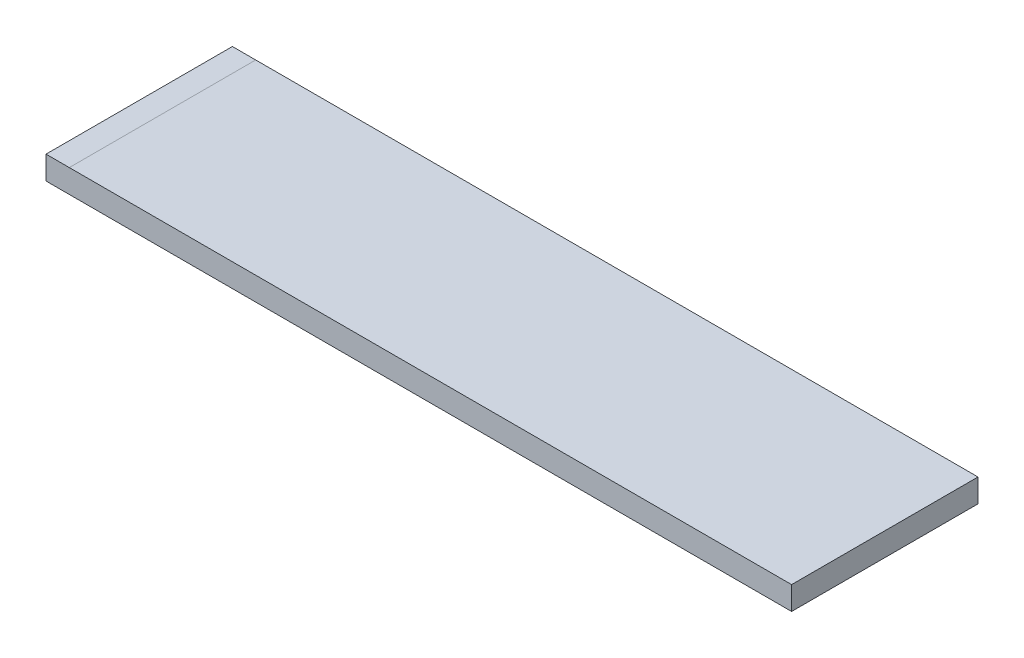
from build123d import *

# Parameters (mm, degrees)
SKETCH1_W           = 203.2
SKETCH1_H           = 6.35
EXTRUDE_THIN1_DEPTH = 25.4


with BuildPart() as part:
    # Sketch1 → Extrude-Thin1 (new, symmetric)
    with BuildSketch(Plane.XY):
        with Locations((101.6, -3.175)):
            Rectangle(SKETCH1_W, SKETCH1_H)
    extrude(amount=EXTRUDE_THIN1_DEPTH, both=True)


solid = part.part
